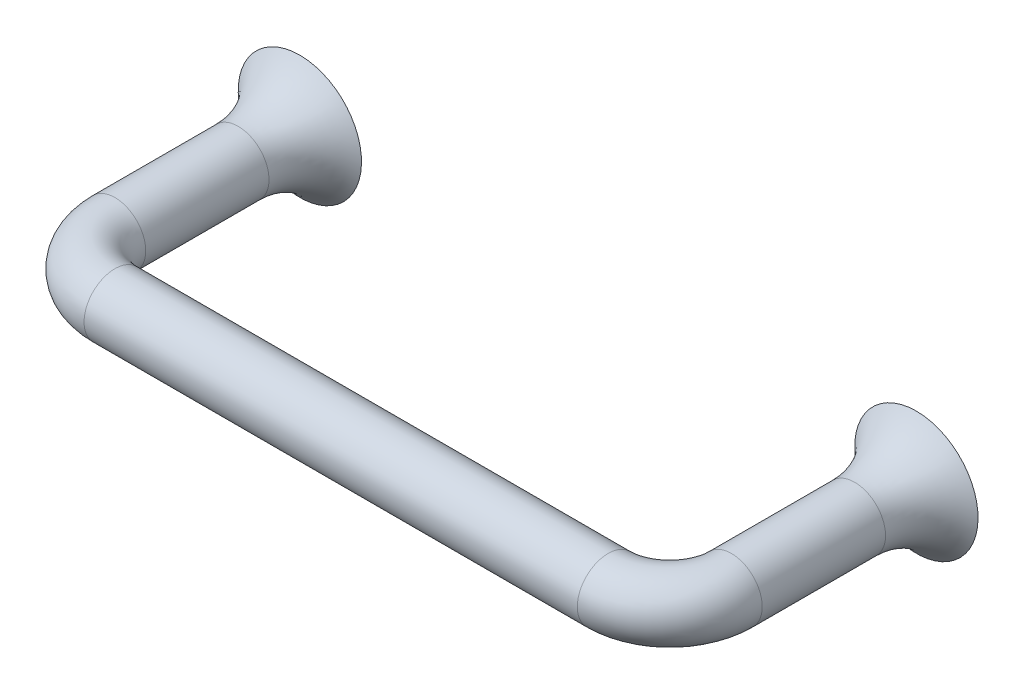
ISO-10303-21;
HEADER;
FILE_DESCRIPTION(('STEP AP214'),'2;1');
FILE_NAME('part.step','',(''),(''),'','','');
FILE_SCHEMA(('AUTOMOTIVE_DESIGN { 1 0 10303 214 1 1 1 1 }'));
ENDSEC;
DATA;
#1=APPLICATION_CONTEXT('core data for automotive mechanical design processes');
#2=APPLICATION_PROTOCOL_DEFINITION('international standard','automotive_design',2000,#1);
#3=PRODUCT_CONTEXT('',#1,'mechanical');
#4=PRODUCT('Part','Part','',(#3));
#5=PRODUCT_RELATED_PRODUCT_CATEGORY('part','',(#4));
#6=PRODUCT_DEFINITION_FORMATION('','',#4);
#7=PRODUCT_DEFINITION_CONTEXT('part definition',#1,'design');
#8=PRODUCT_DEFINITION('design','',#6,#7);
#9=PRODUCT_DEFINITION_SHAPE('','',#8);
#10=(LENGTH_UNIT() NAMED_UNIT(*) SI_UNIT(.MILLI.,.METRE.));
#11=(NAMED_UNIT(*) PLANE_ANGLE_UNIT() SI_UNIT($,.RADIAN.));
#12=(NAMED_UNIT(*) SI_UNIT($,.STERADIAN.) SOLID_ANGLE_UNIT());
#13=UNCERTAINTY_MEASURE_WITH_UNIT(LENGTH_MEASURE(1.E-05),#10,'distance_accuracy_value','');
#14=(GEOMETRIC_REPRESENTATION_CONTEXT(3) GLOBAL_UNCERTAINTY_ASSIGNED_CONTEXT((#13)) GLOBAL_UNIT_ASSIGNED_CONTEXT((#10,
#11,#12)) REPRESENTATION_CONTEXT('',''));
#15=CARTESIAN_POINT('',(0.,0.,0.));
#16=DIRECTION('',(0.,0.,1.));
#17=DIRECTION('',(1.,0.,0.));
#18=AXIS2_PLACEMENT_3D('',#15,#16,#17);
#19=CARTESIAN_POINT('',(-2.91433543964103E-13,0.,30.0000000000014));
#20=DIRECTION('',(0.,0.,-1.));
#21=DIRECTION('',(0.,-1.,0.));
#22=AXIS2_PLACEMENT_3D('',#19,#20,#21);
#23=CYLINDRICAL_SURFACE('',#22,5.);
#24=CARTESIAN_POINT('',(-2.91433543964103E-13,0.,30.0000000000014));
#25=DIRECTION('',(0.,0.,-1.));
#26=DIRECTION('',(0.,1.,0.));
#27=AXIS2_PLACEMENT_3D('',#24,#25,#26);
#28=CIRCLE('',#27,5.);
#29=CARTESIAN_POINT('',(-5.00000000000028,0.,30.0000000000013));
#30=VERTEX_POINT('',#29);
#31=EDGE_CURVE('E32',#30,#30,#28,.T.);
#32=ORIENTED_EDGE('',*,*,#31,.T.);
#33=EDGE_LOOP('',(#32));
#34=FACE_BOUND('',#33,.T.);
#35=CARTESIAN_POINT('',(-2.77555756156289E-13,0.,10.0000000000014));
#36=DIRECTION('',(0.,0.,1.));
#37=DIRECTION('',(0.,1.,0.));
#38=AXIS2_PLACEMENT_3D('',#35,#36,#37);
#39=CIRCLE('',#38,5.);
#40=CARTESIAN_POINT('',(-2.77555756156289E-13,5.,10.0000000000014));
#41=VERTEX_POINT('',#40);
#42=EDGE_CURVE('E47',#41,#41,#39,.T.);
#43=ORIENTED_EDGE('',*,*,#42,.T.);
#44=EDGE_LOOP('',(#43));
#45=FACE_BOUND('',#44,.T.);
#46=ADVANCED_FACE('F12',(#34,#45),#23,.T.);
#47=CARTESIAN_POINT('',(9.99999999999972,0.,30.0000000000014));
#48=DIRECTION('',(0.,-1.,0.));
#49=DIRECTION('',(1.,0.,0.));
#50=AXIS2_PLACEMENT_3D('',#47,#48,#49);
#51=TOROIDAL_SURFACE('',#50,10.,5.);
#52=CARTESIAN_POINT('',(9.9999999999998,0.,40.0000000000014));
#53=DIRECTION('',(-1.,0.,0.));
#54=DIRECTION('',(0.,1.,0.));
#55=AXIS2_PLACEMENT_3D('',#52,#53,#54);
#56=CIRCLE('',#55,5.);
#57=CARTESIAN_POINT('',(9.99999999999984,0.,45.0000000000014));
#58=VERTEX_POINT('',#57);
#59=EDGE_CURVE('E35',#58,#58,#56,.T.);
#60=CARTESIAN_POINT('',(9.99999999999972,0.,30.0000000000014));
#61=DIRECTION('',(0.,-1.,0.));
#62=DIRECTION('',(1.,0.,0.));
#63=AXIS2_PLACEMENT_3D('',#60,#61,#62);
#64=CIRCLE('',#63,15.);
#65=EDGE_CURVE('',#58,#30,#64,.T.);
#66=ORIENTED_EDGE('',*,*,#59,.T.);
#67=ORIENTED_EDGE('',*,*,#31,.F.);
#68=ORIENTED_EDGE('',*,*,#65,.T.);
#69=ORIENTED_EDGE('',*,*,#65,.F.);
#70=EDGE_LOOP('',(#66,#68,#67,#69));
#71=FACE_BOUND('',#70,.T.);
#72=ADVANCED_FACE('F81',(#71),#51,.T.);
#73=CARTESIAN_POINT('',(90.,0.,40.0000000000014));
#74=DIRECTION('',(-1.,0.,0.));
#75=DIRECTION('',(0.,-1.,0.));
#76=AXIS2_PLACEMENT_3D('',#73,#74,#75);
#77=CYLINDRICAL_SURFACE('',#76,5.);
#78=CARTESIAN_POINT('',(90.,0.,40.0000000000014));
#79=DIRECTION('',(-1.,0.,0.));
#80=DIRECTION('',(0.,1.,0.));
#81=AXIS2_PLACEMENT_3D('',#78,#79,#80);
#82=CIRCLE('',#81,5.);
#83=CARTESIAN_POINT('',(90.,0.,45.0000000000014));
#84=VERTEX_POINT('',#83);
#85=EDGE_CURVE('E38',#84,#84,#82,.T.);
#86=ORIENTED_EDGE('',*,*,#85,.T.);
#87=EDGE_LOOP('',(#86));
#88=FACE_BOUND('',#87,.T.);
#89=ORIENTED_EDGE('',*,*,#59,.F.);
#90=EDGE_LOOP('',(#89));
#91=FACE_BOUND('',#90,.T.);
#92=ADVANCED_FACE('F88',(#88,#91),#77,.T.);
#93=CARTESIAN_POINT('',(90.,0.,30.0000000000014));
#94=DIRECTION('',(0.,-1.,0.));
#95=DIRECTION('',(1.,0.,0.));
#96=AXIS2_PLACEMENT_3D('',#93,#94,#95);
#97=TOROIDAL_SURFACE('',#96,10.,5.);
#98=CARTESIAN_POINT('',(100.,0.,30.0000000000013));
#99=DIRECTION('',(0.,0.,1.));
#100=DIRECTION('',(0.,1.,0.));
#101=AXIS2_PLACEMENT_3D('',#98,#99,#100);
#102=CIRCLE('',#101,5.);
#103=CARTESIAN_POINT('',(105.,0.,30.0000000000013));
#104=VERTEX_POINT('',#103);
#105=EDGE_CURVE('E41',#104,#104,#102,.T.);
#106=CARTESIAN_POINT('',(90.,0.,30.0000000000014));
#107=DIRECTION('',(0.,-1.,0.));
#108=DIRECTION('',(1.,0.,0.));
#109=AXIS2_PLACEMENT_3D('',#106,#107,#108);
#110=CIRCLE('',#109,15.);
#111=EDGE_CURVE('',#104,#84,#110,.T.);
#112=ORIENTED_EDGE('',*,*,#105,.T.);
#113=ORIENTED_EDGE('',*,*,#85,.F.);
#114=ORIENTED_EDGE('',*,*,#111,.T.);
#115=ORIENTED_EDGE('',*,*,#111,.F.);
#116=EDGE_LOOP('',(#112,#114,#113,#115));
#117=FACE_BOUND('',#116,.T.);
#118=ADVANCED_FACE('F130',(#117),#97,.T.);
#119=CARTESIAN_POINT('',(100.,0.,30.0000000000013));
#120=DIRECTION('',(0.,0.,-1.));
#121=DIRECTION('',(0.,-1.,0.));
#122=AXIS2_PLACEMENT_3D('',#119,#120,#121);
#123=CYLINDRICAL_SURFACE('',#122,5.);
#124=CARTESIAN_POINT('',(100.,0.,10.0000000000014));
#125=DIRECTION('',(0.,0.,1.));
#126=DIRECTION('',(0.,1.,0.));
#127=AXIS2_PLACEMENT_3D('',#124,#125,#126);
#128=CIRCLE('',#127,5.);
#129=CARTESIAN_POINT('',(100.,5.,10.0000000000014));
#130=VERTEX_POINT('',#129);
#131=EDGE_CURVE('E53',#130,#130,#128,.T.);
#132=ORIENTED_EDGE('',*,*,#131,.T.);
#133=EDGE_LOOP('',(#132));
#134=FACE_BOUND('',#133,.T.);
#135=ORIENTED_EDGE('',*,*,#105,.F.);
#136=EDGE_LOOP('',(#135));
#137=FACE_BOUND('',#136,.T.);
#138=ADVANCED_FACE('F124',(#134,#137),#123,.T.);
#139=CARTESIAN_POINT('',(-2.77555756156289E-13,0.,10.0000000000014));
#140=DIRECTION('',(0.,0.,1.));
#141=DIRECTION('',(0.,1.,0.));
#142=AXIS2_PLACEMENT_3D('',#139,#140,#141);
#143=TOROIDAL_SURFACE('',#142,17.5,12.5);
#144=ORIENTED_EDGE('',*,*,#42,.F.);
#145=EDGE_LOOP('',(#144));
#146=FACE_BOUND('',#145,.T.);
#147=CARTESIAN_POINT('',(-2.77555756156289E-13,0.,1.39275777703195E-12));
#148=DIRECTION('',(0.,0.,1.));
#149=DIRECTION('',(0.,1.,0.));
#150=AXIS2_PLACEMENT_3D('',#147,#148,#149);
#151=CIRCLE('',#150,10.);
#152=CARTESIAN_POINT('',(-2.77555756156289E-13,10.,1.39275777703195E-12));
#153=VERTEX_POINT('',#152);
#154=EDGE_CURVE('E44',#153,#153,#151,.T.);
#155=ORIENTED_EDGE('',*,*,#154,.T.);
#156=EDGE_LOOP('',(#155));
#157=FACE_BOUND('',#156,.T.);
#158=ADVANCED_FACE('F121',(#146,#157),#143,.F.);
#159=CARTESIAN_POINT('',(-2.91433543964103E-13,0.,1.40663556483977E-12));
#160=DIRECTION('',(0.,0.,-1.));
#161=DIRECTION('',(0.,1.,0.));
#162=AXIS2_PLACEMENT_3D('',#159,#160,#161);
#163=PLANE('',#162);
#164=CARTESIAN_POINT('',(-2.77555756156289E-13,0.,1.40663556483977E-12));
#165=DIRECTION('',(0.,0.,-1.));
#166=DIRECTION('',(-1.,0.,0.));
#167=AXIS2_PLACEMENT_3D('',#164,#165,#166);
#168=CIRCLE('',#167,2.9499999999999);
#169=CARTESIAN_POINT('',(-2.95000000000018,0.,1.32446285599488E-12));
#170=VERTEX_POINT('',#169);
#171=EDGE_CURVE('E8',#170,#170,#168,.F.);
#172=ORIENTED_EDGE('',*,*,#171,.T.);
#173=EDGE_LOOP('',(#172));
#174=FACE_BOUND('',#173,.T.);
#175=ORIENTED_EDGE('',*,*,#154,.F.);
#176=EDGE_LOOP('',(#175));
#177=FACE_BOUND('',#176,.T.);
#178=ADVANCED_FACE('F119',(#174,#177),#163,.T.);
#179=CARTESIAN_POINT('',(100.,0.,10.0000000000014));
#180=DIRECTION('',(0.,0.,1.));
#181=DIRECTION('',(0.,1.,0.));
#182=AXIS2_PLACEMENT_3D('',#179,#180,#181);
#183=TOROIDAL_SURFACE('',#182,17.5,12.5);
#184=ORIENTED_EDGE('',*,*,#131,.F.);
#185=EDGE_LOOP('',(#184));
#186=FACE_BOUND('',#185,.T.);
#187=CARTESIAN_POINT('',(100.,0.,1.39275777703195E-12));
#188=DIRECTION('',(0.,0.,1.));
#189=DIRECTION('',(0.,1.,0.));
#190=AXIS2_PLACEMENT_3D('',#187,#188,#189);
#191=CIRCLE('',#190,10.);
#192=CARTESIAN_POINT('',(100.,10.,1.39275777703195E-12));
#193=VERTEX_POINT('',#192);
#194=EDGE_CURVE('E50',#193,#193,#191,.T.);
#195=ORIENTED_EDGE('',*,*,#194,.T.);
#196=EDGE_LOOP('',(#195));
#197=FACE_BOUND('',#196,.T.);
#198=ADVANCED_FACE('F113',(#186,#197),#183,.F.);
#199=CARTESIAN_POINT('',(100.,0.,1.39275777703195E-12));
#200=DIRECTION('',(0.,0.,1.));
#201=DIRECTION('',(0.,1.,0.));
#202=AXIS2_PLACEMENT_3D('',#199,#200,#201);
#203=PLANE('',#202);
#204=CARTESIAN_POINT('',(100.,0.,1.39275777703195E-12));
#205=DIRECTION('',(0.,0.,1.));
#206=DIRECTION('',(1.,0.,0.));
#207=AXIS2_PLACEMENT_3D('',#204,#205,#206);
#208=CIRCLE('',#207,2.95);
#209=CARTESIAN_POINT('',(102.95,0.,1.39275777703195E-12));
#210=VERTEX_POINT('',#209);
#211=EDGE_CURVE('E23',#210,#210,#208,.T.);
#212=ORIENTED_EDGE('',*,*,#211,.T.);
#213=EDGE_LOOP('',(#212));
#214=FACE_BOUND('',#213,.T.);
#215=ORIENTED_EDGE('',*,*,#194,.F.);
#216=EDGE_LOOP('',(#215));
#217=FACE_BOUND('',#216,.T.);
#218=ADVANCED_FACE('F106',(#214,#217),#203,.F.);
#219=CARTESIAN_POINT('',(100.,0.,10.0000000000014));
#220=DIRECTION('',(0.,0.,-1.));
#221=DIRECTION('',(0.,-1.,0.));
#222=AXIS2_PLACEMENT_3D('',#219,#220,#221);
#223=CYLINDRICAL_SURFACE('',#222,2.5);
#224=CARTESIAN_POINT('',(100.,0.,0.450000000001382));
#225=DIRECTION('',(0.,0.,1.));
#226=DIRECTION('',(1.,0.,0.));
#227=AXIS2_PLACEMENT_3D('',#224,#225,#226);
#228=CIRCLE('',#227,2.5);
#229=CARTESIAN_POINT('',(102.5,0.,0.450000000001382));
#230=VERTEX_POINT('',#229);
#231=EDGE_CURVE('E27',#230,#230,#228,.F.);
#232=ORIENTED_EDGE('',*,*,#231,.T.);
#233=EDGE_LOOP('',(#232));
#234=FACE_BOUND('',#233,.T.);
#235=CARTESIAN_POINT('',(100.,0.,10.0000000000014));
#236=DIRECTION('',(0.,0.,-1.));
#237=DIRECTION('',(0.,-1.,0.));
#238=AXIS2_PLACEMENT_3D('',#235,#236,#237);
#239=CIRCLE('',#238,2.5);
#240=CARTESIAN_POINT('',(100.,-2.5,10.0000000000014));
#241=VERTEX_POINT('',#240);
#242=EDGE_CURVE('E56',#241,#241,#239,.T.);
#243=ORIENTED_EDGE('',*,*,#242,.F.);
#244=EDGE_LOOP('',(#243));
#245=FACE_BOUND('',#244,.T.);
#246=ADVANCED_FACE('F77',(#234,#245),#223,.F.);
#247=CARTESIAN_POINT('',(100.,0.,10.0000000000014));
#248=DIRECTION('',(0.,0.,-1.));
#249=DIRECTION('',(0.,-1.,0.));
#250=AXIS2_PLACEMENT_3D('',#247,#248,#249);
#251=PLANE('',#250);
#252=ORIENTED_EDGE('',*,*,#242,.T.);
#253=EDGE_LOOP('',(#252));
#254=FACE_BOUND('',#253,.T.);
#255=ADVANCED_FACE('F67',(#254),#251,.T.);
#256=CARTESIAN_POINT('',(-2.77555756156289E-13,0.,10.0000000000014));
#257=DIRECTION('',(0.,0.,-1.));
#258=DIRECTION('',(0.,-1.,0.));
#259=AXIS2_PLACEMENT_3D('',#256,#257,#258);
#260=CYLINDRICAL_SURFACE('',#259,2.5);
#261=CARTESIAN_POINT('',(-2.77555756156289E-13,0.,0.450000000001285));
#262=DIRECTION('',(0.,0.,-1.));
#263=DIRECTION('',(-1.,0.,0.));
#264=AXIS2_PLACEMENT_3D('',#261,#262,#263);
#265=CIRCLE('',#264,2.5);
#266=CARTESIAN_POINT('',(-2.50000000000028,0.,0.450000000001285));
#267=VERTEX_POINT('',#266);
#268=EDGE_CURVE('E19',#267,#267,#265,.T.);
#269=ORIENTED_EDGE('',*,*,#268,.T.);
#270=EDGE_LOOP('',(#269));
#271=FACE_BOUND('',#270,.T.);
#272=CARTESIAN_POINT('',(-2.77555756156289E-13,0.,10.0000000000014));
#273=DIRECTION('',(0.,0.,-1.));
#274=DIRECTION('',(0.,-1.,0.));
#275=AXIS2_PLACEMENT_3D('',#272,#273,#274);
#276=CIRCLE('',#275,2.5);
#277=CARTESIAN_POINT('',(-2.77555756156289E-13,-2.5,10.0000000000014));
#278=VERTEX_POINT('',#277);
#279=EDGE_CURVE('E59',#278,#278,#276,.T.);
#280=ORIENTED_EDGE('',*,*,#279,.F.);
#281=EDGE_LOOP('',(#280));
#282=FACE_BOUND('',#281,.T.);
#283=ADVANCED_FACE('F65',(#271,#282),#260,.F.);
#284=CARTESIAN_POINT('',(-2.77555756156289E-13,0.,10.0000000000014));
#285=DIRECTION('',(0.,0.,-1.));
#286=DIRECTION('',(0.,-1.,0.));
#287=AXIS2_PLACEMENT_3D('',#284,#285,#286);
#288=PLANE('',#287);
#289=ORIENTED_EDGE('',*,*,#279,.T.);
#290=EDGE_LOOP('',(#289));
#291=FACE_BOUND('',#290,.T.);
#292=ADVANCED_FACE('F63',(#291),#288,.T.);
#293=CARTESIAN_POINT('',(100.,0.,0.450000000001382));
#294=DIRECTION('',(0.,0.,-1.));
#295=DIRECTION('',(-1.,0.,0.));
#296=AXIS2_PLACEMENT_3D('',#293,#294,#295);
#297=CONICAL_SURFACE('',#296,2.5,0.785398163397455);
#298=ORIENTED_EDGE('',*,*,#211,.F.);
#299=EDGE_LOOP('',(#298));
#300=FACE_BOUND('',#299,.T.);
#301=ORIENTED_EDGE('',*,*,#231,.F.);
#302=EDGE_LOOP('',(#301));
#303=FACE_BOUND('',#302,.T.);
#304=ADVANCED_FACE('F75',(#300,#303),#297,.F.);
#305=CARTESIAN_POINT('',(-2.77555756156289E-13,0.,0.450000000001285));
#306=DIRECTION('',(0.,0.,-1.));
#307=DIRECTION('',(-1.,0.,0.));
#308=AXIS2_PLACEMENT_3D('',#305,#306,#307);
#309=CONICAL_SURFACE('',#308,2.5,0.785398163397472);
#310=ORIENTED_EDGE('',*,*,#171,.F.);
#311=EDGE_LOOP('',(#310));
#312=FACE_BOUND('',#311,.T.);
#313=ORIENTED_EDGE('',*,*,#268,.F.);
#314=EDGE_LOOP('',(#313));
#315=FACE_BOUND('',#314,.T.);
#316=ADVANCED_FACE('F14',(#312,#315),#309,.F.);
#317=CLOSED_SHELL('',(#46,#72,#92,#118,#138,#158,#178,#198,#218,#246,#255,#283,#292,#304,#316));
#318=MANIFOLD_SOLID_BREP('B1',#317);
#319=ADVANCED_BREP_SHAPE_REPRESENTATION('',(#18,#318),#14);
#320=SHAPE_DEFINITION_REPRESENTATION(#9,#319);
ENDSEC;
END-ISO-10303-21;
